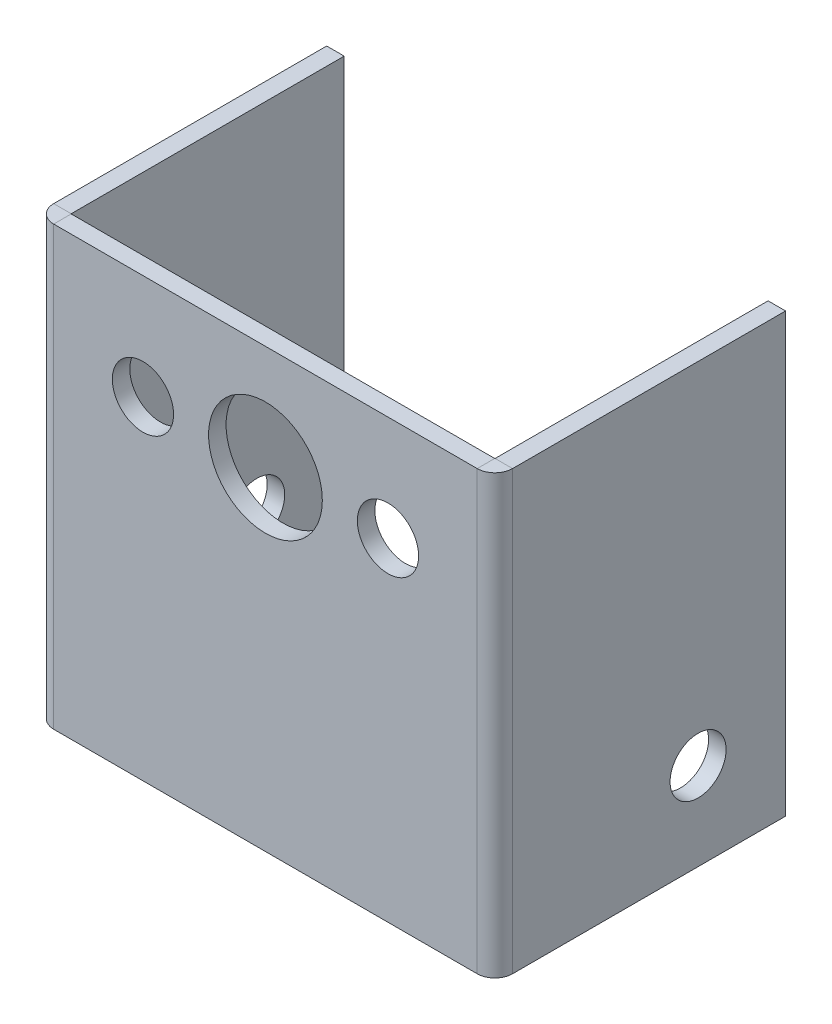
ISO-10303-21;
HEADER;
FILE_DESCRIPTION(('STEP AP214'),'2;1');
FILE_NAME('part.step','',(''),(''),'','','');
FILE_SCHEMA(('AUTOMOTIVE_DESIGN { 1 0 10303 214 1 1 1 1 }'));
ENDSEC;
DATA;
#1=APPLICATION_CONTEXT('core data for automotive mechanical design processes');
#2=APPLICATION_PROTOCOL_DEFINITION('international standard','automotive_design',2000,#1);
#3=PRODUCT_CONTEXT('',#1,'mechanical');
#4=PRODUCT('Part','Part','',(#3));
#5=PRODUCT_RELATED_PRODUCT_CATEGORY('part','',(#4));
#6=PRODUCT_DEFINITION_FORMATION('','',#4);
#7=PRODUCT_DEFINITION_CONTEXT('part definition',#1,'design');
#8=PRODUCT_DEFINITION('design','',#6,#7);
#9=PRODUCT_DEFINITION_SHAPE('','',#8);
#10=(LENGTH_UNIT() NAMED_UNIT(*) SI_UNIT(.MILLI.,.METRE.));
#11=(NAMED_UNIT(*) PLANE_ANGLE_UNIT() SI_UNIT($,.RADIAN.));
#12=(NAMED_UNIT(*) SI_UNIT($,.STERADIAN.) SOLID_ANGLE_UNIT());
#13=UNCERTAINTY_MEASURE_WITH_UNIT(LENGTH_MEASURE(1.E-05),#10,'distance_accuracy_value','');
#14=(GEOMETRIC_REPRESENTATION_CONTEXT(3) GLOBAL_UNCERTAINTY_ASSIGNED_CONTEXT((#13)) GLOBAL_UNIT_ASSIGNED_CONTEXT((#10,
#11,#12)) REPRESENTATION_CONTEXT('',''));
#15=CARTESIAN_POINT('',(0.,0.,0.));
#16=DIRECTION('',(0.,0.,1.));
#17=DIRECTION('',(1.,0.,0.));
#18=AXIS2_PLACEMENT_3D('',#15,#16,#17);
#19=CARTESIAN_POINT('',(0.,25.,1.));
#20=DIRECTION('',(0.,-1.,0.));
#21=DIRECTION('',(0.,0.,-1.));
#22=AXIS2_PLACEMENT_3D('',#19,#20,#21);
#23=PLANE('',#22);
#24=DIRECTION('',(-1.,0.,0.));
#25=VECTOR('',#24,1.);
#26=CARTESIAN_POINT('',(0.,25.,0.));
#27=LINE('',#26,#25);
#28=CARTESIAN_POINT('',(40.5994469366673,25.,0.));
#29=VERTEX_POINT('',#28);
#30=CARTESIAN_POINT('',(16.4005530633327,25.,-1.14802731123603E-08));
#31=VERTEX_POINT('',#30);
#32=EDGE_CURVE('E63',#29,#31,#27,.T.);
#33=ORIENTED_EDGE('',*,*,#32,.T.);
#34=DIRECTION('',(0.,0.,1.));
#35=VECTOR('',#34,1.);
#36=CARTESIAN_POINT('',(16.4005530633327,25.,1.));
#37=LINE('',#36,#35);
#38=CARTESIAN_POINT('',(16.4005530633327,25.,0.999999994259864));
#39=VERTEX_POINT('',#38);
#40=EDGE_CURVE('E274',#31,#39,#37,.T.);
#41=ORIENTED_EDGE('',*,*,#40,.T.);
#42=DIRECTION('',(-1.,0.,0.));
#43=VECTOR('',#42,1.);
#44=CARTESIAN_POINT('',(0.,25.,1.));
#45=LINE('',#44,#43);
#46=CARTESIAN_POINT('',(40.5994469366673,25.,1.00000001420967));
#47=VERTEX_POINT('',#46);
#48=EDGE_CURVE('E44',#47,#39,#45,.T.);
#49=ORIENTED_EDGE('',*,*,#48,.F.);
#50=DIRECTION('',(0.,0.,1.));
#51=VECTOR('',#50,1.);
#52=CARTESIAN_POINT('',(40.5994469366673,25.,1.));
#53=LINE('',#52,#51);
#54=EDGE_CURVE('E268',#29,#47,#53,.T.);
#55=ORIENTED_EDGE('',*,*,#54,.F.);
#56=EDGE_LOOP('',(#33,#41,#49,#55));
#57=FACE_BOUND('',#56,.T.);
#58=ADVANCED_FACE('F40',(#57),#23,.F.);
#59=CARTESIAN_POINT('',(0.,0.,1.));
#60=DIRECTION('',(0.,1.,0.));
#61=DIRECTION('',(0.,0.,1.));
#62=AXIS2_PLACEMENT_3D('',#59,#60,#61);
#63=PLANE('',#62);
#64=DIRECTION('',(1.,0.,0.));
#65=VECTOR('',#64,1.);
#66=CARTESIAN_POINT('',(0.,0.,1.));
#67=LINE('',#66,#65);
#68=CARTESIAN_POINT('',(16.4005530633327,0.,0.999999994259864));
#69=VERTEX_POINT('',#68);
#70=CARTESIAN_POINT('',(40.5994469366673,0.,1.));
#71=VERTEX_POINT('',#70);
#72=EDGE_CURVE('E279',#69,#71,#67,.T.);
#73=ORIENTED_EDGE('',*,*,#72,.F.);
#74=DIRECTION('',(0.,0.,-1.));
#75=VECTOR('',#74,1.);
#76=CARTESIAN_POINT('',(16.4005530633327,0.,1.));
#77=LINE('',#76,#75);
#78=CARTESIAN_POINT('',(16.4005530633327,0.,0.));
#79=VERTEX_POINT('',#78);
#80=EDGE_CURVE('E12',#69,#79,#77,.T.);
#81=ORIENTED_EDGE('',*,*,#80,.T.);
#82=DIRECTION('',(1.,0.,0.));
#83=VECTOR('',#82,1.);
#84=CARTESIAN_POINT('',(0.,0.,0.));
#85=LINE('',#84,#83);
#86=CARTESIAN_POINT('',(40.5994469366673,0.,0.));
#87=VERTEX_POINT('',#86);
#88=EDGE_CURVE('E259',#79,#87,#85,.T.);
#89=ORIENTED_EDGE('',*,*,#88,.T.);
#90=DIRECTION('',(0.,0.,-1.));
#91=VECTOR('',#90,1.);
#92=CARTESIAN_POINT('',(40.5994469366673,0.,1.));
#93=LINE('',#92,#91);
#94=EDGE_CURVE('E263',#71,#87,#93,.T.);
#95=ORIENTED_EDGE('',*,*,#94,.F.);
#96=EDGE_LOOP('',(#73,#81,#89,#95));
#97=FACE_BOUND('',#96,.T.);
#98=ADVANCED_FACE('F42',(#97),#63,.F.);
#99=CARTESIAN_POINT('',(0.,25.,1.));
#100=DIRECTION('',(0.,0.,-1.));
#101=DIRECTION('',(-1.,0.,0.));
#102=AXIS2_PLACEMENT_3D('',#99,#100,#101);
#103=PLANE('',#102);
#104=CARTESIAN_POINT('',(35.5,19.,1.));
#105=DIRECTION('',(0.,0.,1.));
#106=DIRECTION('',(1.,0.,0.));
#107=AXIS2_PLACEMENT_3D('',#104,#105,#106);
#108=CIRCLE('',#107,1.75);
#109=CARTESIAN_POINT('',(37.25,19.,1.));
#110=VERTEX_POINT('',#109);
#111=EDGE_CURVE('E244',#110,#110,#108,.T.);
#112=ORIENTED_EDGE('',*,*,#111,.F.);
#113=EDGE_LOOP('',(#112));
#114=FACE_BOUND('',#113,.T.);
#115=CARTESIAN_POINT('',(28.5,19.,1.));
#116=DIRECTION('',(0.,0.,1.));
#117=DIRECTION('',(1.,0.,0.));
#118=AXIS2_PLACEMENT_3D('',#115,#116,#117);
#119=CIRCLE('',#118,3.25);
#120=CARTESIAN_POINT('',(31.75,19.,1.));
#121=VERTEX_POINT('',#120);
#122=EDGE_CURVE('E256',#121,#121,#119,.T.);
#123=ORIENTED_EDGE('',*,*,#122,.F.);
#124=EDGE_LOOP('',(#123));
#125=FACE_BOUND('',#124,.T.);
#126=CARTESIAN_POINT('',(21.5,19.,1.));
#127=DIRECTION('',(0.,0.,1.));
#128=DIRECTION('',(1.,0.,0.));
#129=AXIS2_PLACEMENT_3D('',#126,#127,#128);
#130=CIRCLE('',#129,1.75);
#131=CARTESIAN_POINT('',(23.25,19.,1.));
#132=VERTEX_POINT('',#131);
#133=EDGE_CURVE('E250',#132,#132,#130,.T.);
#134=ORIENTED_EDGE('',*,*,#133,.F.);
#135=EDGE_LOOP('',(#134));
#136=FACE_BOUND('',#135,.T.);
#137=ORIENTED_EDGE('',*,*,#48,.T.);
#138=DIRECTION('',(0.,-1.,0.));
#139=VECTOR('',#138,1.);
#140=CARTESIAN_POINT('',(16.4005530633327,25.,1.));
#141=LINE('',#140,#139);
#142=EDGE_CURVE('E271',#39,#69,#141,.T.);
#143=ORIENTED_EDGE('',*,*,#142,.T.);
#144=ORIENTED_EDGE('',*,*,#72,.T.);
#145=DIRECTION('',(0.,-1.,0.));
#146=VECTOR('',#145,1.);
#147=CARTESIAN_POINT('',(40.5994469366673,25.,1.));
#148=LINE('',#147,#146);
#149=EDGE_CURVE('E260',#47,#71,#148,.T.);
#150=ORIENTED_EDGE('',*,*,#149,.F.);
#151=EDGE_LOOP('',(#137,#143,#144,#150));
#152=FACE_BOUND('',#151,.T.);
#153=ADVANCED_FACE('F285',(#114,#125,#136,#152),#103,.F.);
#154=CARTESIAN_POINT('',(0.,25.,0.));
#155=DIRECTION('',(0.,0.,-1.));
#156=DIRECTION('',(-1.,0.,0.));
#157=AXIS2_PLACEMENT_3D('',#154,#155,#156);
#158=PLANE('',#157);
#159=DIRECTION('',(0.,-1.,0.));
#160=VECTOR('',#159,1.);
#161=CARTESIAN_POINT('',(16.4005530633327,25.,0.));
#162=LINE('',#161,#160);
#163=EDGE_CURVE('E49',#31,#79,#162,.T.);
#164=ORIENTED_EDGE('',*,*,#163,.F.);
#165=ORIENTED_EDGE('',*,*,#32,.F.);
#166=DIRECTION('',(0.,-1.,0.));
#167=VECTOR('',#166,1.);
#168=CARTESIAN_POINT('',(40.5994469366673,25.,0.));
#169=LINE('',#168,#167);
#170=EDGE_CURVE('E266',#29,#87,#169,.T.);
#171=ORIENTED_EDGE('',*,*,#170,.T.);
#172=ORIENTED_EDGE('',*,*,#88,.F.);
#173=EDGE_LOOP('',(#164,#165,#171,#172));
#174=FACE_BOUND('',#173,.T.);
#175=CARTESIAN_POINT('',(21.5,19.,0.));
#176=DIRECTION('',(0.,0.,1.));
#177=DIRECTION('',(1.,0.,0.));
#178=AXIS2_PLACEMENT_3D('',#175,#176,#177);
#179=CIRCLE('',#178,1.75);
#180=CARTESIAN_POINT('',(23.25,19.,0.));
#181=VERTEX_POINT('',#180);
#182=EDGE_CURVE('E247',#181,#181,#179,.T.);
#183=ORIENTED_EDGE('',*,*,#182,.T.);
#184=EDGE_LOOP('',(#183));
#185=FACE_BOUND('',#184,.T.);
#186=CARTESIAN_POINT('',(28.5,19.,0.));
#187=DIRECTION('',(0.,0.,1.));
#188=DIRECTION('',(1.,0.,0.));
#189=AXIS2_PLACEMENT_3D('',#186,#187,#188);
#190=CIRCLE('',#189,3.25);
#191=CARTESIAN_POINT('',(31.75,19.,0.));
#192=VERTEX_POINT('',#191);
#193=EDGE_CURVE('E253',#192,#192,#190,.T.);
#194=ORIENTED_EDGE('',*,*,#193,.T.);
#195=EDGE_LOOP('',(#194));
#196=FACE_BOUND('',#195,.T.);
#197=CARTESIAN_POINT('',(35.5,19.,0.));
#198=DIRECTION('',(0.,0.,1.));
#199=DIRECTION('',(1.,0.,0.));
#200=AXIS2_PLACEMENT_3D('',#197,#198,#199);
#201=CIRCLE('',#200,1.75);
#202=CARTESIAN_POINT('',(37.25,19.,0.));
#203=VERTEX_POINT('',#202);
#204=EDGE_CURVE('E241',#203,#203,#201,.T.);
#205=ORIENTED_EDGE('',*,*,#204,.T.);
#206=EDGE_LOOP('',(#205));
#207=FACE_BOUND('',#206,.T.);
#208=ADVANCED_FACE('F320',(#174,#185,#196,#207),#158,.T.);
#209=CARTESIAN_POINT('',(28.5,19.,1.));
#210=DIRECTION('',(0.,0.,-1.));
#211=DIRECTION('',(-1.,0.,0.));
#212=AXIS2_PLACEMENT_3D('',#209,#210,#211);
#213=CYLINDRICAL_SURFACE('',#212,3.25);
#214=ORIENTED_EDGE('',*,*,#122,.T.);
#215=EDGE_LOOP('',(#214));
#216=FACE_BOUND('',#215,.T.);
#217=ORIENTED_EDGE('',*,*,#193,.F.);
#218=EDGE_LOOP('',(#217));
#219=FACE_BOUND('',#218,.T.);
#220=ADVANCED_FACE('F322',(#216,#219),#213,.F.);
#221=CARTESIAN_POINT('',(21.5,19.,1.));
#222=DIRECTION('',(0.,0.,-1.));
#223=DIRECTION('',(-1.,0.,0.));
#224=AXIS2_PLACEMENT_3D('',#221,#222,#223);
#225=CYLINDRICAL_SURFACE('',#224,1.75);
#226=ORIENTED_EDGE('',*,*,#133,.T.);
#227=EDGE_LOOP('',(#226));
#228=FACE_BOUND('',#227,.T.);
#229=ORIENTED_EDGE('',*,*,#182,.F.);
#230=EDGE_LOOP('',(#229));
#231=FACE_BOUND('',#230,.T.);
#232=ADVANCED_FACE('F327',(#228,#231),#225,.F.);
#233=CARTESIAN_POINT('',(35.5,19.,1.));
#234=DIRECTION('',(0.,0.,-1.));
#235=DIRECTION('',(-1.,0.,0.));
#236=AXIS2_PLACEMENT_3D('',#233,#234,#235);
#237=CYLINDRICAL_SURFACE('',#236,1.75);
#238=ORIENTED_EDGE('',*,*,#111,.T.);
#239=EDGE_LOOP('',(#238));
#240=FACE_BOUND('',#239,.T.);
#241=ORIENTED_EDGE('',*,*,#204,.F.);
#242=EDGE_LOOP('',(#241));
#243=FACE_BOUND('',#242,.T.);
#244=ADVANCED_FACE('F337',(#240,#243),#237,.F.);
#245=CARTESIAN_POINT('',(40.5994469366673,25.,-0.0100000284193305));
#246=DIRECTION('',(0.,1.,0.));
#247=DIRECTION('',(0.,0.,1.));
#248=AXIS2_PLACEMENT_3D('',#245,#246,#247);
#249=PLANE('',#248);
#250=DIRECTION('',(1.,0.,0.));
#251=VECTOR('',#250,1.);
#252=CARTESIAN_POINT('',(41.6094469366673,25.,-0.0100000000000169));
#253=LINE('',#252,#251);
#254=CARTESIAN_POINT('',(40.6094469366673,25.,-0.00999999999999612));
#255=VERTEX_POINT('',#254);
#256=CARTESIAN_POINT('',(41.6094469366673,25.,-0.0100000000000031));
#257=VERTEX_POINT('',#256);
#258=EDGE_CURVE('E198',#255,#257,#253,.T.);
#259=ORIENTED_EDGE('',*,*,#258,.F.);
#260=CARTESIAN_POINT('',(40.5994469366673,25.,-0.01));
#261=DIRECTION('',(0.,1.,0.));
#262=DIRECTION('',(0.,0.,1.));
#263=AXIS2_PLACEMENT_3D('',#260,#261,#262);
#264=CIRCLE('',#263,0.0100000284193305);
#265=EDGE_CURVE('E197',#255,#29,#264,.F.);
#266=ORIENTED_EDGE('',*,*,#265,.T.);
#267=ORIENTED_EDGE('',*,*,#54,.T.);
#268=CARTESIAN_POINT('',(40.5994469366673,25.,-0.0100000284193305));
#269=DIRECTION('',(0.,-1.,0.));
#270=DIRECTION('',(0.,0.,-1.));
#271=AXIS2_PLACEMENT_3D('',#268,#269,#270);
#272=CIRCLE('',#271,1.010000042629);
#273=EDGE_CURVE('E233',#257,#47,#272,.T.);
#274=ORIENTED_EDGE('',*,*,#273,.F.);
#275=EDGE_LOOP('',(#259,#266,#267,#274));
#276=FACE_BOUND('',#275,.T.);
#277=ADVANCED_FACE('F339',(#276),#249,.T.);
#278=CARTESIAN_POINT('',(40.5994469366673,0.,-0.0100000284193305));
#279=DIRECTION('',(0.,-1.,0.));
#280=DIRECTION('',(0.,0.,-1.));
#281=AXIS2_PLACEMENT_3D('',#278,#279,#280);
#282=PLANE('',#281);
#283=ORIENTED_EDGE('',*,*,#94,.T.);
#284=CARTESIAN_POINT('',(40.5994469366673,0.,-0.01));
#285=DIRECTION('',(0.,1.,0.));
#286=DIRECTION('',(0.,0.,1.));
#287=AXIS2_PLACEMENT_3D('',#284,#285,#286);
#288=CIRCLE('',#287,0.0100000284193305);
#289=CARTESIAN_POINT('',(40.6094469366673,0.,-0.00999999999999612));
#290=VERTEX_POINT('',#289);
#291=EDGE_CURVE('E230',#87,#290,#288,.T.);
#292=ORIENTED_EDGE('',*,*,#291,.T.);
#293=DIRECTION('',(-1.,0.,0.));
#294=VECTOR('',#293,1.);
#295=CARTESIAN_POINT('',(41.6094469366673,0.,-0.0100000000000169));
#296=LINE('',#295,#294);
#297=CARTESIAN_POINT('',(41.6094469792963,0.,-0.0099999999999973));
#298=VERTEX_POINT('',#297);
#299=EDGE_CURVE('E208',#298,#290,#296,.T.);
#300=ORIENTED_EDGE('',*,*,#299,.F.);
#301=CARTESIAN_POINT('',(40.5994469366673,0.,-0.0100000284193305));
#302=DIRECTION('',(0.,1.,0.));
#303=DIRECTION('',(0.,0.,1.));
#304=AXIS2_PLACEMENT_3D('',#301,#302,#303);
#305=CIRCLE('',#304,1.010000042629);
#306=EDGE_CURVE('E238',#71,#298,#305,.T.);
#307=ORIENTED_EDGE('',*,*,#306,.F.);
#308=EDGE_LOOP('',(#283,#292,#300,#307));
#309=FACE_BOUND('',#308,.T.);
#310=ADVANCED_FACE('F346',(#309),#282,.T.);
#311=CARTESIAN_POINT('',(40.5994469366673,-12.532813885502,-0.01));
#312=DIRECTION('',(0.,1.,0.));
#313=DIRECTION('',(0.,0.,1.));
#314=AXIS2_PLACEMENT_3D('',#311,#312,#313);
#315=CYLINDRICAL_SURFACE('',#314,1.01000002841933);
#316=ORIENTED_EDGE('',*,*,#306,.T.);
#317=DIRECTION('',(0.,-1.,0.));
#318=VECTOR('',#317,1.);
#319=CARTESIAN_POINT('',(41.6094469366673,25.,-0.0100000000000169));
#320=LINE('',#319,#318);
#321=EDGE_CURVE('E215',#257,#298,#320,.T.);
#322=ORIENTED_EDGE('',*,*,#321,.F.);
#323=ORIENTED_EDGE('',*,*,#273,.T.);
#324=ORIENTED_EDGE('',*,*,#149,.T.);
#325=EDGE_LOOP('',(#316,#322,#323,#324));
#326=FACE_BOUND('',#325,.T.);
#327=ADVANCED_FACE('F354',(#326),#315,.T.);
#328=CARTESIAN_POINT('',(40.5994469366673,-12.532813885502,-0.01));
#329=DIRECTION('',(0.,1.,0.));
#330=DIRECTION('',(0.,0.,1.));
#331=AXIS2_PLACEMENT_3D('',#328,#329,#330);
#332=CYLINDRICAL_SURFACE('',#331,0.0100000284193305);
#333=ORIENTED_EDGE('',*,*,#291,.F.);
#334=ORIENTED_EDGE('',*,*,#170,.F.);
#335=ORIENTED_EDGE('',*,*,#265,.F.);
#336=DIRECTION('',(0.,-1.,0.));
#337=VECTOR('',#336,1.);
#338=CARTESIAN_POINT('',(40.6094469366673,25.,-0.01000000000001));
#339=LINE('',#338,#337);
#340=EDGE_CURVE('E193',#255,#290,#339,.T.);
#341=ORIENTED_EDGE('',*,*,#340,.T.);
#342=EDGE_LOOP('',(#333,#334,#335,#341));
#343=FACE_BOUND('',#342,.T.);
#344=ADVANCED_FACE('F358',(#343),#332,.F.);
#345=CARTESIAN_POINT('',(41.6094469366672,0.,-15.6094469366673));
#346=DIRECTION('',(0.,0.,1.));
#347=DIRECTION('',(1.,0.,0.));
#348=AXIS2_PLACEMENT_3D('',#345,#346,#347);
#349=PLANE('',#348);
#350=DIRECTION('',(0.,1.,0.));
#351=VECTOR('',#350,1.);
#352=CARTESIAN_POINT('',(40.6094469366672,0.,-15.6094469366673));
#353=LINE('',#352,#351);
#354=CARTESIAN_POINT('',(40.6094469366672,0.,-15.6094469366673));
#355=VERTEX_POINT('',#354);
#356=CARTESIAN_POINT('',(40.6094469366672,25.,-15.6094469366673));
#357=VERTEX_POINT('',#356);
#358=EDGE_CURVE('E226',#355,#357,#353,.T.);
#359=ORIENTED_EDGE('',*,*,#358,.T.);
#360=DIRECTION('',(-1.,0.,0.));
#361=VECTOR('',#360,1.);
#362=CARTESIAN_POINT('',(41.6094469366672,25.,-15.6094469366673));
#363=LINE('',#362,#361);
#364=CARTESIAN_POINT('',(41.6094469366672,25.,-15.6094469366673));
#365=VERTEX_POINT('',#364);
#366=EDGE_CURVE('E194',#365,#357,#363,.T.);
#367=ORIENTED_EDGE('',*,*,#366,.F.);
#368=DIRECTION('',(0.,1.,0.));
#369=VECTOR('',#368,1.);
#370=CARTESIAN_POINT('',(41.6094469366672,0.,-15.6094469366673));
#371=LINE('',#370,#369);
#372=CARTESIAN_POINT('',(41.6094469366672,0.,-15.6094469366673));
#373=VERTEX_POINT('',#372);
#374=EDGE_CURVE('E211',#373,#365,#371,.T.);
#375=ORIENTED_EDGE('',*,*,#374,.F.);
#376=DIRECTION('',(-1.,0.,0.));
#377=VECTOR('',#376,1.);
#378=CARTESIAN_POINT('',(41.6094469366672,0.,-15.6094469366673));
#379=LINE('',#378,#377);
#380=EDGE_CURVE('E223',#373,#355,#379,.T.);
#381=ORIENTED_EDGE('',*,*,#380,.T.);
#382=EDGE_LOOP('',(#359,#367,#375,#381));
#383=FACE_BOUND('',#382,.T.);
#384=ADVANCED_FACE('F362',(#383),#349,.F.);
#385=CARTESIAN_POINT('',(41.6094469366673,5.,-10.6094469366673));
#386=DIRECTION('',(-1.,0.,0.));
#387=DIRECTION('',(0.,0.,1.));
#388=AXIS2_PLACEMENT_3D('',#385,#386,#387);
#389=CYLINDRICAL_SURFACE('',#388,1.6);
#390=CARTESIAN_POINT('',(41.6094469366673,5.,-10.6094469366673));
#391=DIRECTION('',(1.,0.,0.));
#392=DIRECTION('',(0.,0.,-1.));
#393=AXIS2_PLACEMENT_3D('',#390,#391,#392);
#394=CIRCLE('',#393,1.6);
#395=CARTESIAN_POINT('',(41.6094469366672,5.,-12.2094469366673));
#396=VERTEX_POINT('',#395);
#397=EDGE_CURVE('E220',#396,#396,#394,.T.);
#398=ORIENTED_EDGE('',*,*,#397,.T.);
#399=EDGE_LOOP('',(#398));
#400=FACE_BOUND('',#399,.T.);
#401=CARTESIAN_POINT('',(40.6094469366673,5.,-10.6094469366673));
#402=DIRECTION('',(1.,0.,0.));
#403=DIRECTION('',(0.,0.,-1.));
#404=AXIS2_PLACEMENT_3D('',#401,#402,#403);
#405=CIRCLE('',#404,1.6);
#406=CARTESIAN_POINT('',(40.6094469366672,5.,-12.2094469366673));
#407=VERTEX_POINT('',#406);
#408=EDGE_CURVE('E203',#407,#407,#405,.T.);
#409=ORIENTED_EDGE('',*,*,#408,.F.);
#410=EDGE_LOOP('',(#409));
#411=FACE_BOUND('',#410,.T.);
#412=ADVANCED_FACE('F379',(#400,#411),#389,.F.);
#413=CARTESIAN_POINT('',(41.6094469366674,25.,41.3905530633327));
#414=DIRECTION('',(-1.,0.,0.));
#415=DIRECTION('',(0.,0.,1.));
#416=AXIS2_PLACEMENT_3D('',#413,#414,#415);
#417=PLANE('',#416);
#418=ORIENTED_EDGE('',*,*,#397,.F.);
#419=EDGE_LOOP('',(#418));
#420=FACE_BOUND('',#419,.T.);
#421=DIRECTION('',(0.,0.,1.));
#422=VECTOR('',#421,1.);
#423=CARTESIAN_POINT('',(41.6094469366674,25.,41.3905530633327));
#424=LINE('',#423,#422);
#425=EDGE_CURVE('E218',#365,#257,#424,.T.);
#426=ORIENTED_EDGE('',*,*,#425,.T.);
#427=ORIENTED_EDGE('',*,*,#321,.T.);
#428=DIRECTION('',(0.,0.,-1.));
#429=VECTOR('',#428,1.);
#430=CARTESIAN_POINT('',(41.6094469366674,0.,41.3905530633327));
#431=LINE('',#430,#429);
#432=EDGE_CURVE('E213',#298,#373,#431,.T.);
#433=ORIENTED_EDGE('',*,*,#432,.T.);
#434=ORIENTED_EDGE('',*,*,#374,.T.);
#435=EDGE_LOOP('',(#426,#427,#433,#434));
#436=FACE_BOUND('',#435,.T.);
#437=ADVANCED_FACE('F375',(#420,#436),#417,.F.);
#438=CARTESIAN_POINT('',(41.6094469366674,0.,41.3905530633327));
#439=DIRECTION('',(0.,1.,0.));
#440=DIRECTION('',(1.,0.,0.));
#441=AXIS2_PLACEMENT_3D('',#438,#439,#440);
#442=PLANE('',#441);
#443=ORIENTED_EDGE('',*,*,#432,.F.);
#444=ORIENTED_EDGE('',*,*,#299,.T.);
#445=DIRECTION('',(0.,0.,-1.));
#446=VECTOR('',#445,1.);
#447=CARTESIAN_POINT('',(40.6094469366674,0.,41.3905530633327));
#448=LINE('',#447,#446);
#449=EDGE_CURVE('E206',#290,#355,#448,.T.);
#450=ORIENTED_EDGE('',*,*,#449,.T.);
#451=ORIENTED_EDGE('',*,*,#380,.F.);
#452=EDGE_LOOP('',(#443,#444,#450,#451));
#453=FACE_BOUND('',#452,.T.);
#454=ADVANCED_FACE('F371',(#453),#442,.F.);
#455=CARTESIAN_POINT('',(40.6094469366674,25.,41.3905530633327));
#456=DIRECTION('',(-1.,0.,0.));
#457=DIRECTION('',(0.,0.,1.));
#458=AXIS2_PLACEMENT_3D('',#455,#456,#457);
#459=PLANE('',#458);
#460=ORIENTED_EDGE('',*,*,#340,.F.);
#461=DIRECTION('',(0.,0.,1.));
#462=VECTOR('',#461,1.);
#463=CARTESIAN_POINT('',(40.6094469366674,25.,41.3905530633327));
#464=LINE('',#463,#462);
#465=EDGE_CURVE('E201',#357,#255,#464,.T.);
#466=ORIENTED_EDGE('',*,*,#465,.F.);
#467=ORIENTED_EDGE('',*,*,#358,.F.);
#468=ORIENTED_EDGE('',*,*,#449,.F.);
#469=EDGE_LOOP('',(#460,#466,#467,#468));
#470=FACE_BOUND('',#469,.T.);
#471=ORIENTED_EDGE('',*,*,#408,.T.);
#472=EDGE_LOOP('',(#471));
#473=FACE_BOUND('',#472,.T.);
#474=ADVANCED_FACE('F367',(#470,#473),#459,.T.);
#475=CARTESIAN_POINT('',(41.6094469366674,25.,41.3905530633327));
#476=DIRECTION('',(0.,-1.,0.));
#477=DIRECTION('',(-1.,0.,0.));
#478=AXIS2_PLACEMENT_3D('',#475,#476,#477);
#479=PLANE('',#478);
#480=ORIENTED_EDGE('',*,*,#465,.T.);
#481=ORIENTED_EDGE('',*,*,#258,.T.);
#482=ORIENTED_EDGE('',*,*,#425,.F.);
#483=ORIENTED_EDGE('',*,*,#366,.T.);
#484=EDGE_LOOP('',(#480,#481,#482,#483));
#485=FACE_BOUND('',#484,.T.);
#486=ADVANCED_FACE('F364',(#485),#479,.F.);
#487=CARTESIAN_POINT('',(16.4005530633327,25.,-0.00999998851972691));
#488=DIRECTION('',(0.,1.,0.));
#489=DIRECTION('',(0.,0.,1.));
#490=AXIS2_PLACEMENT_3D('',#487,#488,#489);
#491=PLANE('',#490);
#492=ORIENTED_EDGE('',*,*,#40,.F.);
#493=CARTESIAN_POINT('',(16.4005530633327,25.,-0.01));
#494=DIRECTION('',(0.,-1.,0.));
#495=DIRECTION('',(0.,0.,-1.));
#496=AXIS2_PLACEMENT_3D('',#493,#494,#495);
#497=CIRCLE('',#496,0.00999998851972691);
#498=CARTESIAN_POINT('',(16.3905530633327,25.,-0.00999999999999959));
#499=VERTEX_POINT('',#498);
#500=EDGE_CURVE('E161',#31,#499,#497,.T.);
#501=ORIENTED_EDGE('',*,*,#500,.T.);
#502=DIRECTION('',(-1.,0.,0.));
#503=VECTOR('',#502,1.);
#504=CARTESIAN_POINT('',(15.3905530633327,25.,-0.00999999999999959));
#505=LINE('',#504,#503);
#506=CARTESIAN_POINT('',(15.3905530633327,25.,-0.0100000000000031));
#507=VERTEX_POINT('',#506);
#508=EDGE_CURVE('E177',#499,#507,#505,.T.);
#509=ORIENTED_EDGE('',*,*,#508,.T.);
#510=CARTESIAN_POINT('',(16.4005530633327,25.,-0.00999998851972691));
#511=DIRECTION('',(0.,-1.,0.));
#512=DIRECTION('',(0.,0.,-1.));
#513=AXIS2_PLACEMENT_3D('',#510,#511,#512);
#514=CIRCLE('',#513,1.00999998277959);
#515=EDGE_CURVE('E185',#39,#507,#514,.T.);
#516=ORIENTED_EDGE('',*,*,#515,.F.);
#517=EDGE_LOOP('',(#492,#501,#509,#516));
#518=FACE_BOUND('',#517,.T.);
#519=ADVANCED_FACE('F289',(#518),#491,.T.);
#520=CARTESIAN_POINT('',(16.4005530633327,0.,-0.00999998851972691));
#521=DIRECTION('',(0.,-1.,0.));
#522=DIRECTION('',(0.,0.,-1.));
#523=AXIS2_PLACEMENT_3D('',#520,#521,#522);
#524=PLANE('',#523);
#525=DIRECTION('',(1.,0.,0.));
#526=VECTOR('',#525,1.);
#527=CARTESIAN_POINT('',(15.3905530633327,0.,-0.00999999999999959));
#528=LINE('',#527,#526);
#529=CARTESIAN_POINT('',(15.390553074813,0.,-0.00999999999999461));
#530=VERTEX_POINT('',#529);
#531=CARTESIAN_POINT('',(16.3905530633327,0.,-0.00999999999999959));
#532=VERTEX_POINT('',#531);
#533=EDGE_CURVE('E140',#530,#532,#528,.T.);
#534=ORIENTED_EDGE('',*,*,#533,.T.);
#535=CARTESIAN_POINT('',(16.4005530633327,0.,-0.01));
#536=DIRECTION('',(0.,-1.,0.));
#537=DIRECTION('',(0.,0.,-1.));
#538=AXIS2_PLACEMENT_3D('',#535,#536,#537);
#539=CIRCLE('',#538,0.00999998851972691);
#540=EDGE_CURVE('E183',#532,#79,#539,.F.);
#541=ORIENTED_EDGE('',*,*,#540,.T.);
#542=ORIENTED_EDGE('',*,*,#80,.F.);
#543=CARTESIAN_POINT('',(16.4005530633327,0.,-0.00999998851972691));
#544=DIRECTION('',(0.,1.,0.));
#545=DIRECTION('',(0.,0.,1.));
#546=AXIS2_PLACEMENT_3D('',#543,#544,#545);
#547=CIRCLE('',#546,1.00999998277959);
#548=EDGE_CURVE('E190',#530,#69,#547,.T.);
#549=ORIENTED_EDGE('',*,*,#548,.F.);
#550=EDGE_LOOP('',(#534,#541,#542,#549));
#551=FACE_BOUND('',#550,.T.);
#552=ADVANCED_FACE('F297',(#551),#524,.T.);
#553=CARTESIAN_POINT('',(16.4005530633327,37.532813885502,-0.01));
#554=DIRECTION('',(0.,-1.,0.));
#555=DIRECTION('',(0.,0.,-1.));
#556=AXIS2_PLACEMENT_3D('',#553,#554,#555);
#557=CYLINDRICAL_SURFACE('',#556,1.00999998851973);
#558=ORIENTED_EDGE('',*,*,#548,.T.);
#559=ORIENTED_EDGE('',*,*,#142,.F.);
#560=ORIENTED_EDGE('',*,*,#515,.T.);
#561=DIRECTION('',(0.,-1.,0.));
#562=VECTOR('',#561,1.);
#563=CARTESIAN_POINT('',(15.3905530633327,25.,-0.00999999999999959));
#564=LINE('',#563,#562);
#565=EDGE_CURVE('E181',#507,#530,#564,.T.);
#566=ORIENTED_EDGE('',*,*,#565,.T.);
#567=EDGE_LOOP('',(#558,#559,#560,#566));
#568=FACE_BOUND('',#567,.T.);
#569=ADVANCED_FACE('F300',(#568),#557,.T.);
#570=CARTESIAN_POINT('',(16.4005530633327,37.532813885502,-0.01));
#571=DIRECTION('',(0.,-1.,0.));
#572=DIRECTION('',(0.,0.,-1.));
#573=AXIS2_PLACEMENT_3D('',#570,#571,#572);
#574=CYLINDRICAL_SURFACE('',#573,0.00999998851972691);
#575=ORIENTED_EDGE('',*,*,#540,.F.);
#576=DIRECTION('',(0.,-1.,0.));
#577=VECTOR('',#576,1.);
#578=CARTESIAN_POINT('',(16.3905530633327,25.,-0.00999999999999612));
#579=LINE('',#578,#577);
#580=EDGE_CURVE('E159',#499,#532,#579,.T.);
#581=ORIENTED_EDGE('',*,*,#580,.F.);
#582=ORIENTED_EDGE('',*,*,#500,.F.);
#583=ORIENTED_EDGE('',*,*,#163,.T.);
#584=EDGE_LOOP('',(#575,#581,#582,#583));
#585=FACE_BOUND('',#584,.T.);
#586=ADVANCED_FACE('F291',(#585),#574,.F.);
#587=CARTESIAN_POINT('',(15.3905530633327,5.,-10.6094469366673));
#588=DIRECTION('',(1.,0.,0.));
#589=DIRECTION('',(0.,0.,-1.));
#590=AXIS2_PLACEMENT_3D('',#587,#588,#589);
#591=CYLINDRICAL_SURFACE('',#590,1.6);
#592=CARTESIAN_POINT('',(15.3905530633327,5.,-10.6094469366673));
#593=DIRECTION('',(-1.,0.,0.));
#594=DIRECTION('',(0.,0.,1.));
#595=AXIS2_PLACEMENT_3D('',#592,#593,#594);
#596=CIRCLE('',#595,1.6);
#597=CARTESIAN_POINT('',(15.3905530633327,5.,-9.0094469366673));
#598=VERTEX_POINT('',#597);
#599=EDGE_CURVE('E174',#598,#598,#596,.T.);
#600=ORIENTED_EDGE('',*,*,#599,.T.);
#601=EDGE_LOOP('',(#600));
#602=FACE_BOUND('',#601,.T.);
#603=CARTESIAN_POINT('',(16.3905530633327,5.,-10.6094469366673));
#604=DIRECTION('',(-1.,0.,0.));
#605=DIRECTION('',(0.,0.,1.));
#606=AXIS2_PLACEMENT_3D('',#603,#604,#605);
#607=CIRCLE('',#606,1.6);
#608=CARTESIAN_POINT('',(16.3905530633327,5.,-9.0094469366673));
#609=VERTEX_POINT('',#608);
#610=EDGE_CURVE('E164',#609,#609,#607,.T.);
#611=ORIENTED_EDGE('',*,*,#610,.F.);
#612=EDGE_LOOP('',(#611));
#613=FACE_BOUND('',#612,.T.);
#614=ADVANCED_FACE('F395',(#602,#613),#591,.F.);
#615=CARTESIAN_POINT('',(15.3905530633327,0.,-15.6094469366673));
#616=DIRECTION('',(0.,0.,1.));
#617=DIRECTION('',(1.,0.,0.));
#618=AXIS2_PLACEMENT_3D('',#615,#616,#617);
#619=PLANE('',#618);
#620=DIRECTION('',(0.,-1.,0.));
#621=VECTOR('',#620,1.);
#622=CARTESIAN_POINT('',(16.3905530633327,0.,-15.6094469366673));
#623=LINE('',#622,#621);
#624=CARTESIAN_POINT('',(16.3905530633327,25.,-15.6094469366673));
#625=VERTEX_POINT('',#624);
#626=CARTESIAN_POINT('',(16.3905530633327,0.,-15.6094469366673));
#627=VERTEX_POINT('',#626);
#628=EDGE_CURVE('E157',#625,#627,#623,.T.);
#629=ORIENTED_EDGE('',*,*,#628,.T.);
#630=DIRECTION('',(1.,0.,0.));
#631=VECTOR('',#630,1.);
#632=CARTESIAN_POINT('',(15.3905530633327,0.,-15.6094469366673));
#633=LINE('',#632,#631);
#634=CARTESIAN_POINT('',(15.3905530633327,0.,-15.6094469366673));
#635=VERTEX_POINT('',#634);
#636=EDGE_CURVE('E137',#635,#627,#633,.T.);
#637=ORIENTED_EDGE('',*,*,#636,.F.);
#638=DIRECTION('',(0.,-1.,0.));
#639=VECTOR('',#638,1.);
#640=CARTESIAN_POINT('',(15.3905530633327,0.,-15.6094469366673));
#641=LINE('',#640,#639);
#642=CARTESIAN_POINT('',(15.3905530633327,25.,-15.6094469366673));
#643=VERTEX_POINT('',#642);
#644=EDGE_CURVE('E144',#643,#635,#641,.T.);
#645=ORIENTED_EDGE('',*,*,#644,.F.);
#646=DIRECTION('',(1.,0.,0.));
#647=VECTOR('',#646,1.);
#648=CARTESIAN_POINT('',(15.3905530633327,25.,-15.6094469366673));
#649=LINE('',#648,#647);
#650=EDGE_CURVE('E171',#643,#625,#649,.T.);
#651=ORIENTED_EDGE('',*,*,#650,.T.);
#652=EDGE_LOOP('',(#629,#637,#645,#651));
#653=FACE_BOUND('',#652,.T.);
#654=ADVANCED_FACE('F155',(#653),#619,.F.);
#655=CARTESIAN_POINT('',(15.3905530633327,25.,-15.6094469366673));
#656=DIRECTION('',(1.,0.,0.));
#657=DIRECTION('',(0.,0.,-1.));
#658=AXIS2_PLACEMENT_3D('',#655,#656,#657);
#659=PLANE('',#658);
#660=ORIENTED_EDGE('',*,*,#565,.F.);
#661=DIRECTION('',(0.,0.,-1.));
#662=VECTOR('',#661,1.);
#663=CARTESIAN_POINT('',(15.3905530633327,25.,-15.6094469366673));
#664=LINE('',#663,#662);
#665=EDGE_CURVE('E150',#507,#643,#664,.T.);
#666=ORIENTED_EDGE('',*,*,#665,.T.);
#667=ORIENTED_EDGE('',*,*,#644,.T.);
#668=DIRECTION('',(0.,0.,1.));
#669=VECTOR('',#668,1.);
#670=CARTESIAN_POINT('',(15.3905530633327,0.,-15.6094469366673));
#671=LINE('',#670,#669);
#672=EDGE_CURVE('E133',#635,#530,#671,.T.);
#673=ORIENTED_EDGE('',*,*,#672,.T.);
#674=EDGE_LOOP('',(#660,#666,#667,#673));
#675=FACE_BOUND('',#674,.T.);
#676=ORIENTED_EDGE('',*,*,#599,.F.);
#677=EDGE_LOOP('',(#676));
#678=FACE_BOUND('',#677,.T.);
#679=ADVANCED_FACE('F147',(#675,#678),#659,.F.);
#680=CARTESIAN_POINT('',(15.3905530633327,25.,-15.6094469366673));
#681=DIRECTION('',(0.,-1.,0.));
#682=DIRECTION('',(1.,0.,0.));
#683=AXIS2_PLACEMENT_3D('',#680,#681,#682);
#684=PLANE('',#683);
#685=ORIENTED_EDGE('',*,*,#508,.F.);
#686=DIRECTION('',(0.,0.,-1.));
#687=VECTOR('',#686,1.);
#688=CARTESIAN_POINT('',(16.3905530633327,25.,-15.6094469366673));
#689=LINE('',#688,#687);
#690=EDGE_CURVE('E143',#499,#625,#689,.T.);
#691=ORIENTED_EDGE('',*,*,#690,.T.);
#692=ORIENTED_EDGE('',*,*,#650,.F.);
#693=ORIENTED_EDGE('',*,*,#665,.F.);
#694=EDGE_LOOP('',(#685,#691,#692,#693));
#695=FACE_BOUND('',#694,.T.);
#696=ADVANCED_FACE('F302',(#695),#684,.F.);
#697=CARTESIAN_POINT('',(16.3905530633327,25.,-15.6094469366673));
#698=DIRECTION('',(1.,0.,0.));
#699=DIRECTION('',(0.,0.,-1.));
#700=AXIS2_PLACEMENT_3D('',#697,#698,#699);
#701=PLANE('',#700);
#702=ORIENTED_EDGE('',*,*,#610,.T.);
#703=EDGE_LOOP('',(#702));
#704=FACE_BOUND('',#703,.T.);
#705=ORIENTED_EDGE('',*,*,#690,.F.);
#706=ORIENTED_EDGE('',*,*,#580,.T.);
#707=DIRECTION('',(0.,0.,1.));
#708=VECTOR('',#707,1.);
#709=CARTESIAN_POINT('',(16.3905530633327,0.,-15.6094469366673));
#710=LINE('',#709,#708);
#711=EDGE_CURVE('E158',#627,#532,#710,.T.);
#712=ORIENTED_EDGE('',*,*,#711,.F.);
#713=ORIENTED_EDGE('',*,*,#628,.F.);
#714=EDGE_LOOP('',(#705,#706,#712,#713));
#715=FACE_BOUND('',#714,.T.);
#716=ADVANCED_FACE('F293',(#704,#715),#701,.T.);
#717=CARTESIAN_POINT('',(15.3905530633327,0.,-15.6094469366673));
#718=DIRECTION('',(0.,1.,0.));
#719=DIRECTION('',(-1.,0.,0.));
#720=AXIS2_PLACEMENT_3D('',#717,#718,#719);
#721=PLANE('',#720);
#722=ORIENTED_EDGE('',*,*,#533,.F.);
#723=ORIENTED_EDGE('',*,*,#672,.F.);
#724=ORIENTED_EDGE('',*,*,#636,.T.);
#725=ORIENTED_EDGE('',*,*,#711,.T.);
#726=EDGE_LOOP('',(#722,#723,#724,#725));
#727=FACE_BOUND('',#726,.T.);
#728=ADVANCED_FACE('F135',(#727),#721,.F.);
#729=CLOSED_SHELL('',(#58,#98,#153,#208,#220,#232,#244,#277,#310,#327,#344,#384,#412,#437,#454,
#474,#486,#519,#552,#569,#586,#614,#654,#679,#696,#716,#728));
#730=MANIFOLD_SOLID_BREP('B2',#729);
#731=ADVANCED_BREP_SHAPE_REPRESENTATION('',(#18,#730),#14);
#732=SHAPE_DEFINITION_REPRESENTATION(#9,#731);
ENDSEC;
END-ISO-10303-21;
